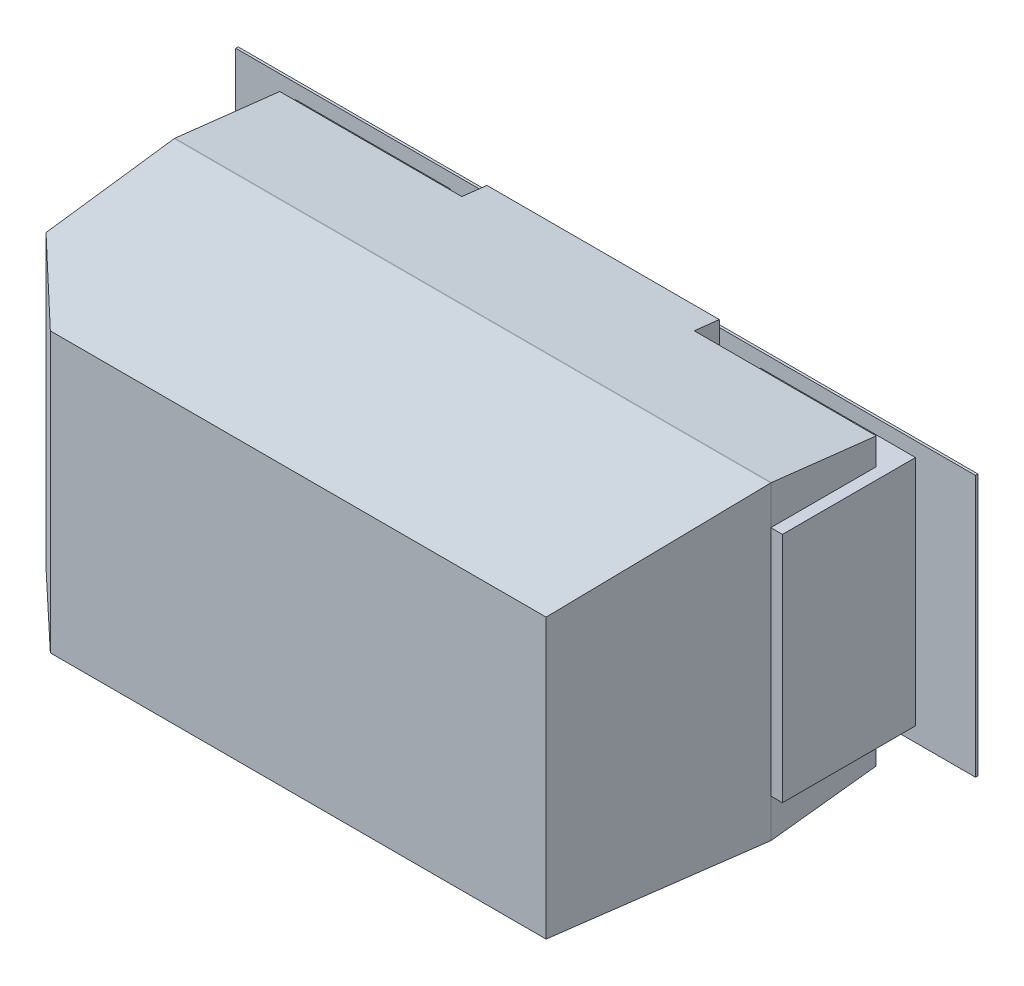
ISO-10303-21;
HEADER;
FILE_DESCRIPTION(('STEP AP214'),'2;1');
FILE_NAME('part.step','',(''),(''),'','','');
FILE_SCHEMA(('AUTOMOTIVE_DESIGN { 1 0 10303 214 1 1 1 1 }'));
ENDSEC;
DATA;
#1=APPLICATION_CONTEXT('core data for automotive mechanical design processes');
#2=APPLICATION_PROTOCOL_DEFINITION('international standard','automotive_design',2000,#1);
#3=PRODUCT_CONTEXT('',#1,'mechanical');
#4=PRODUCT('Part','Part','',(#3));
#5=PRODUCT_RELATED_PRODUCT_CATEGORY('part','',(#4));
#6=PRODUCT_DEFINITION_FORMATION('','',#4);
#7=PRODUCT_DEFINITION_CONTEXT('part definition',#1,'design');
#8=PRODUCT_DEFINITION('design','',#6,#7);
#9=PRODUCT_DEFINITION_SHAPE('','',#8);
#10=(LENGTH_UNIT() NAMED_UNIT(*) SI_UNIT(.MILLI.,.METRE.));
#11=(NAMED_UNIT(*) PLANE_ANGLE_UNIT() SI_UNIT($,.RADIAN.));
#12=(NAMED_UNIT(*) SI_UNIT($,.STERADIAN.) SOLID_ANGLE_UNIT());
#13=UNCERTAINTY_MEASURE_WITH_UNIT(LENGTH_MEASURE(1.E-05),#10,'distance_accuracy_value','');
#14=(GEOMETRIC_REPRESENTATION_CONTEXT(3) GLOBAL_UNCERTAINTY_ASSIGNED_CONTEXT((#13)) GLOBAL_UNIT_ASSIGNED_CONTEXT((#10,
#11,#12)) REPRESENTATION_CONTEXT('',''));
#15=CARTESIAN_POINT('',(0.,0.,0.));
#16=DIRECTION('',(0.,0.,1.));
#17=DIRECTION('',(1.,0.,0.));
#18=AXIS2_PLACEMENT_3D('',#15,#16,#17);
#19=CARTESIAN_POINT('',(-0.800000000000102,-0.599999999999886,0.0762));
#20=DIRECTION('',(0.,0.,-1.));
#21=DIRECTION('',(-1.,0.,0.));
#22=AXIS2_PLACEMENT_3D('',#19,#20,#21);
#23=PLANE('',#22);
#24=DIRECTION('',(0.,1.,0.));
#25=VECTOR('',#24,1.);
#26=CARTESIAN_POINT('',(-1.90999999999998,0.675000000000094,0.0762));
#27=LINE('',#26,#25);
#28=CARTESIAN_POINT('',(-1.90999999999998,0.675000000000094,0.0762));
#29=VERTEX_POINT('',#28);
#30=CARTESIAN_POINT('',(-1.90999999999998,-0.675000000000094,0.0762));
#31=VERTEX_POINT('',#30);
#32=EDGE_CURVE('E19',#29,#31,#27,.F.);
#33=ORIENTED_EDGE('',*,*,#32,.F.);
#34=DIRECTION('',(1.,0.,0.));
#35=VECTOR('',#34,1.);
#36=CARTESIAN_POINT('',(-0.490000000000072,0.675000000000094,0.0762));
#37=LINE('',#36,#35);
#38=CARTESIAN_POINT('',(-0.490000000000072,0.675000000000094,0.0762));
#39=VERTEX_POINT('',#38);
#40=EDGE_CURVE('E281',#39,#29,#37,.F.);
#41=ORIENTED_EDGE('',*,*,#40,.F.);
#42=DIRECTION('',(0.,1.,0.));
#43=VECTOR('',#42,1.);
#44=CARTESIAN_POINT('',(-0.490000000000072,-0.675000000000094,0.0762));
#45=LINE('',#44,#43);
#46=CARTESIAN_POINT('',(-0.490000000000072,-0.675000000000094,0.0762));
#47=VERTEX_POINT('',#46);
#48=EDGE_CURVE('E266',#47,#39,#45,.T.);
#49=ORIENTED_EDGE('',*,*,#48,.F.);
#50=DIRECTION('',(1.,0.,0.));
#51=VECTOR('',#50,1.);
#52=CARTESIAN_POINT('',(-1.90999999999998,-0.675000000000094,0.0762));
#53=LINE('',#52,#51);
#54=EDGE_CURVE('E253',#31,#47,#53,.T.);
#55=ORIENTED_EDGE('',*,*,#54,.F.);
#56=EDGE_LOOP('',(#33,#41,#49,#55));
#57=FACE_BOUND('',#56,.T.);
#58=ADVANCED_FACE('F16',(#57),#23,.T.);
#59=CARTESIAN_POINT('',(-0.800000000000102,-0.599999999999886,0.0762));
#60=DIRECTION('',(0.,0.,-1.));
#61=DIRECTION('',(-1.,0.,0.));
#62=AXIS2_PLACEMENT_3D('',#59,#60,#61);
#63=PLANE('',#62);
#64=DIRECTION('',(0.,1.,0.));
#65=VECTOR('',#64,1.);
#66=CARTESIAN_POINT('',(0.490000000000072,0.675000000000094,0.0762));
#67=LINE('',#66,#65);
#68=CARTESIAN_POINT('',(0.490000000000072,0.675000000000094,0.0762));
#69=VERTEX_POINT('',#68);
#70=CARTESIAN_POINT('',(0.490000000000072,-0.675000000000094,0.0762));
#71=VERTEX_POINT('',#70);
#72=EDGE_CURVE('E283',#69,#71,#67,.F.);
#73=ORIENTED_EDGE('',*,*,#72,.F.);
#74=DIRECTION('',(1.,0.,0.));
#75=VECTOR('',#74,1.);
#76=CARTESIAN_POINT('',(1.90999999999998,0.675000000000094,0.0762));
#77=LINE('',#76,#75);
#78=CARTESIAN_POINT('',(1.90999999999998,0.675000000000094,0.0762));
#79=VERTEX_POINT('',#78);
#80=EDGE_CURVE('E301',#79,#69,#77,.F.);
#81=ORIENTED_EDGE('',*,*,#80,.F.);
#82=DIRECTION('',(0.,1.,0.));
#83=VECTOR('',#82,1.);
#84=CARTESIAN_POINT('',(1.90999999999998,-0.675000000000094,0.0762));
#85=LINE('',#84,#83);
#86=CARTESIAN_POINT('',(1.90999999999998,-0.675000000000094,0.0762));
#87=VERTEX_POINT('',#86);
#88=EDGE_CURVE('E293',#87,#79,#85,.T.);
#89=ORIENTED_EDGE('',*,*,#88,.F.);
#90=DIRECTION('',(1.,0.,0.));
#91=VECTOR('',#90,1.);
#92=CARTESIAN_POINT('',(0.490000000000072,-0.675000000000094,0.0762));
#93=LINE('',#92,#91);
#94=EDGE_CURVE('E288',#71,#87,#93,.T.);
#95=ORIENTED_EDGE('',*,*,#94,.F.);
#96=EDGE_LOOP('',(#73,#81,#89,#95));
#97=FACE_BOUND('',#96,.T.);
#98=ADVANCED_FACE('F981',(#97),#63,.T.);
#99=CARTESIAN_POINT('',(-1.90999999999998,0.675000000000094,0.0762));
#100=DIRECTION('',(-1.,0.,0.));
#101=DIRECTION('',(0.,0.,1.));
#102=AXIS2_PLACEMENT_3D('',#99,#100,#101);
#103=PLANE('',#102);
#104=DIRECTION('',(0.,0.,1.));
#105=VECTOR('',#104,1.);
#106=CARTESIAN_POINT('',(-1.90999999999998,0.675000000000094,0.0762));
#107=LINE('',#106,#105);
#108=CARTESIAN_POINT('',(-1.90999999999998,0.675000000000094,0.0889));
#109=VERTEX_POINT('',#108);
#110=EDGE_CURVE('E262',#29,#109,#107,.T.);
#111=ORIENTED_EDGE('',*,*,#110,.F.);
#112=ORIENTED_EDGE('',*,*,#32,.T.);
#113=DIRECTION('',(0.,0.,-1.));
#114=VECTOR('',#113,1.);
#115=CARTESIAN_POINT('',(-1.90999999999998,-0.675000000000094,0.0762));
#116=LINE('',#115,#114);
#117=CARTESIAN_POINT('',(-1.90999999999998,-0.675000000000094,0.0889));
#118=VERTEX_POINT('',#117);
#119=EDGE_CURVE('E259',#118,#31,#116,.T.);
#120=ORIENTED_EDGE('',*,*,#119,.F.);
#121=DIRECTION('',(0.,1.,0.));
#122=VECTOR('',#121,1.);
#123=CARTESIAN_POINT('',(-1.90999999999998,0.,0.0889));
#124=LINE('',#123,#122);
#125=EDGE_CURVE('E304',#109,#118,#124,.F.);
#126=ORIENTED_EDGE('',*,*,#125,.F.);
#127=EDGE_LOOP('',(#111,#112,#120,#126));
#128=FACE_BOUND('',#127,.T.);
#129=ADVANCED_FACE('F258',(#128),#103,.T.);
#130=CARTESIAN_POINT('',(-1.90999999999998,-0.675000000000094,0.0762));
#131=DIRECTION('',(0.,-1.,0.));
#132=DIRECTION('',(0.,0.,-1.));
#133=AXIS2_PLACEMENT_3D('',#130,#131,#132);
#134=PLANE('',#133);
#135=ORIENTED_EDGE('',*,*,#119,.T.);
#136=ORIENTED_EDGE('',*,*,#54,.T.);
#137=DIRECTION('',(0.,0.,-1.));
#138=VECTOR('',#137,1.);
#139=CARTESIAN_POINT('',(-0.490000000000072,-0.675000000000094,0.0762));
#140=LINE('',#139,#138);
#141=CARTESIAN_POINT('',(-0.490000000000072,-0.675000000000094,0.0889));
#142=VERTEX_POINT('',#141);
#143=EDGE_CURVE('E268',#142,#47,#140,.T.);
#144=ORIENTED_EDGE('',*,*,#143,.F.);
#145=DIRECTION('',(1.,0.,0.));
#146=VECTOR('',#145,1.);
#147=CARTESIAN_POINT('',(0.,-0.675000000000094,0.0889));
#148=LINE('',#147,#146);
#149=EDGE_CURVE('E272',#118,#142,#148,.T.);
#150=ORIENTED_EDGE('',*,*,#149,.F.);
#151=EDGE_LOOP('',(#135,#136,#144,#150));
#152=FACE_BOUND('',#151,.T.);
#153=ADVANCED_FACE('F270',(#152),#134,.T.);
#154=CARTESIAN_POINT('',(-0.490000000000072,-0.675000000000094,0.0762));
#155=DIRECTION('',(1.,0.,0.));
#156=DIRECTION('',(0.,0.,-1.));
#157=AXIS2_PLACEMENT_3D('',#154,#155,#156);
#158=PLANE('',#157);
#159=ORIENTED_EDGE('',*,*,#143,.T.);
#160=ORIENTED_EDGE('',*,*,#48,.T.);
#161=DIRECTION('',(0.,0.,1.));
#162=VECTOR('',#161,1.);
#163=CARTESIAN_POINT('',(-0.490000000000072,0.675000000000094,0.0762));
#164=LINE('',#163,#162);
#165=CARTESIAN_POINT('',(-0.490000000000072,0.675000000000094,0.0889));
#166=VERTEX_POINT('',#165);
#167=EDGE_CURVE('E278',#166,#39,#164,.F.);
#168=ORIENTED_EDGE('',*,*,#167,.F.);
#169=DIRECTION('',(0.,1.,0.));
#170=VECTOR('',#169,1.);
#171=CARTESIAN_POINT('',(-0.490000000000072,0.,0.0889));
#172=LINE('',#171,#170);
#173=EDGE_CURVE('E307',#142,#166,#172,.T.);
#174=ORIENTED_EDGE('',*,*,#173,.F.);
#175=EDGE_LOOP('',(#159,#160,#168,#174));
#176=FACE_BOUND('',#175,.T.);
#177=ADVANCED_FACE('F1035',(#176),#158,.T.);
#178=CARTESIAN_POINT('',(-0.490000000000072,0.675000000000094,0.0762));
#179=DIRECTION('',(0.,1.,0.));
#180=DIRECTION('',(0.,0.,1.));
#181=AXIS2_PLACEMENT_3D('',#178,#179,#180);
#182=PLANE('',#181);
#183=ORIENTED_EDGE('',*,*,#167,.T.);
#184=ORIENTED_EDGE('',*,*,#40,.T.);
#185=ORIENTED_EDGE('',*,*,#110,.T.);
#186=DIRECTION('',(1.,0.,0.));
#187=VECTOR('',#186,1.);
#188=CARTESIAN_POINT('',(0.,0.675000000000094,0.0889));
#189=LINE('',#188,#187);
#190=EDGE_CURVE('E310',#166,#109,#189,.F.);
#191=ORIENTED_EDGE('',*,*,#190,.F.);
#192=EDGE_LOOP('',(#183,#184,#185,#191));
#193=FACE_BOUND('',#192,.T.);
#194=ADVANCED_FACE('F1042',(#193),#182,.T.);
#195=CARTESIAN_POINT('',(0.490000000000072,0.675000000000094,0.0762));
#196=DIRECTION('',(-1.,0.,0.));
#197=DIRECTION('',(0.,0.,1.));
#198=AXIS2_PLACEMENT_3D('',#195,#196,#197);
#199=PLANE('',#198);
#200=DIRECTION('',(0.,0.,1.));
#201=VECTOR('',#200,1.);
#202=CARTESIAN_POINT('',(0.490000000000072,0.675000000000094,0.0762));
#203=LINE('',#202,#201);
#204=CARTESIAN_POINT('',(0.490000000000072,0.675000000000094,0.0889));
#205=VERTEX_POINT('',#204);
#206=EDGE_CURVE('E295',#69,#205,#203,.T.);
#207=ORIENTED_EDGE('',*,*,#206,.F.);
#208=ORIENTED_EDGE('',*,*,#72,.T.);
#209=DIRECTION('',(0.,0.,-1.));
#210=VECTOR('',#209,1.);
#211=CARTESIAN_POINT('',(0.490000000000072,-0.675000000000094,0.0762));
#212=LINE('',#211,#210);
#213=CARTESIAN_POINT('',(0.490000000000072,-0.675000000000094,0.0889));
#214=VERTEX_POINT('',#213);
#215=EDGE_CURVE('E285',#214,#71,#212,.T.);
#216=ORIENTED_EDGE('',*,*,#215,.F.);
#217=DIRECTION('',(0.,1.,0.));
#218=VECTOR('',#217,1.);
#219=CARTESIAN_POINT('',(0.490000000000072,0.,0.0889));
#220=LINE('',#219,#218);
#221=EDGE_CURVE('E345',#205,#214,#220,.F.);
#222=ORIENTED_EDGE('',*,*,#221,.F.);
#223=EDGE_LOOP('',(#207,#208,#216,#222));
#224=FACE_BOUND('',#223,.T.);
#225=ADVANCED_FACE('F1050',(#224),#199,.T.);
#226=CARTESIAN_POINT('',(0.490000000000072,-0.675000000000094,0.0762));
#227=DIRECTION('',(0.,-1.,0.));
#228=DIRECTION('',(0.,0.,-1.));
#229=AXIS2_PLACEMENT_3D('',#226,#227,#228);
#230=PLANE('',#229);
#231=ORIENTED_EDGE('',*,*,#215,.T.);
#232=ORIENTED_EDGE('',*,*,#94,.T.);
#233=DIRECTION('',(0.,0.,-1.));
#234=VECTOR('',#233,1.);
#235=CARTESIAN_POINT('',(1.90999999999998,-0.675000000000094,0.0762));
#236=LINE('',#235,#234);
#237=CARTESIAN_POINT('',(1.90999999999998,-0.675000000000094,0.0889));
#238=VERTEX_POINT('',#237);
#239=EDGE_CURVE('E290',#238,#87,#236,.T.);
#240=ORIENTED_EDGE('',*,*,#239,.F.);
#241=DIRECTION('',(1.,0.,0.));
#242=VECTOR('',#241,1.);
#243=CARTESIAN_POINT('',(0.,-0.675000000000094,0.0889));
#244=LINE('',#243,#242);
#245=EDGE_CURVE('E348',#214,#238,#244,.T.);
#246=ORIENTED_EDGE('',*,*,#245,.F.);
#247=EDGE_LOOP('',(#231,#232,#240,#246));
#248=FACE_BOUND('',#247,.T.);
#249=ADVANCED_FACE('F1058',(#248),#230,.T.);
#250=CARTESIAN_POINT('',(1.90999999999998,-0.675000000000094,0.0762));
#251=DIRECTION('',(1.,0.,0.));
#252=DIRECTION('',(0.,0.,-1.));
#253=AXIS2_PLACEMENT_3D('',#250,#251,#252);
#254=PLANE('',#253);
#255=ORIENTED_EDGE('',*,*,#239,.T.);
#256=ORIENTED_EDGE('',*,*,#88,.T.);
#257=DIRECTION('',(0.,0.,1.));
#258=VECTOR('',#257,1.);
#259=CARTESIAN_POINT('',(1.90999999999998,0.675000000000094,0.0762));
#260=LINE('',#259,#258);
#261=CARTESIAN_POINT('',(1.90999999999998,0.675000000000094,0.0889));
#262=VERTEX_POINT('',#261);
#263=EDGE_CURVE('E298',#262,#79,#260,.F.);
#264=ORIENTED_EDGE('',*,*,#263,.F.);
#265=DIRECTION('',(0.,1.,0.));
#266=VECTOR('',#265,1.);
#267=CARTESIAN_POINT('',(1.90999999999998,0.,0.0889));
#268=LINE('',#267,#266);
#269=EDGE_CURVE('E351',#238,#262,#268,.T.);
#270=ORIENTED_EDGE('',*,*,#269,.F.);
#271=EDGE_LOOP('',(#255,#256,#264,#270));
#272=FACE_BOUND('',#271,.T.);
#273=ADVANCED_FACE('F1066',(#272),#254,.T.);
#274=CARTESIAN_POINT('',(1.90999999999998,0.675000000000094,0.0762));
#275=DIRECTION('',(0.,1.,0.));
#276=DIRECTION('',(0.,0.,1.));
#277=AXIS2_PLACEMENT_3D('',#274,#275,#276);
#278=PLANE('',#277);
#279=ORIENTED_EDGE('',*,*,#263,.T.);
#280=ORIENTED_EDGE('',*,*,#80,.T.);
#281=ORIENTED_EDGE('',*,*,#206,.T.);
#282=DIRECTION('',(1.,0.,0.));
#283=VECTOR('',#282,1.);
#284=CARTESIAN_POINT('',(0.,0.675000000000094,0.0889));
#285=LINE('',#284,#283);
#286=EDGE_CURVE('E354',#262,#205,#285,.F.);
#287=ORIENTED_EDGE('',*,*,#286,.F.);
#288=EDGE_LOOP('',(#279,#280,#281,#287));
#289=FACE_BOUND('',#288,.T.);
#290=ADVANCED_FACE('F972',(#289),#278,.T.);
#291=CARTESIAN_POINT('',(0.,0.,0.0889));
#292=DIRECTION('',(0.,0.,1.));
#293=DIRECTION('',(1.,0.,0.));
#294=AXIS2_PLACEMENT_3D('',#291,#292,#293);
#295=PLANE('',#294);
#296=DIRECTION('',(0.,1.,0.));
#297=VECTOR('',#296,1.);
#298=CARTESIAN_POINT('',(-0.800000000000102,-0.599999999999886,0.0889));
#299=LINE('',#298,#297);
#300=CARTESIAN_POINT('',(-0.800000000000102,-0.599999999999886,0.0889));
#301=VERTEX_POINT('',#300);
#302=CARTESIAN_POINT('',(-0.800000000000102,0.599999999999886,0.0889));
#303=VERTEX_POINT('',#302);
#304=EDGE_CURVE('E313',#301,#303,#299,.T.);
#305=ORIENTED_EDGE('',*,*,#304,.F.);
#306=DIRECTION('',(1.,0.,0.));
#307=VECTOR('',#306,1.);
#308=CARTESIAN_POINT('',(0.,-0.599999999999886,0.0889));
#309=LINE('',#308,#307);
#310=CARTESIAN_POINT('',(-1.59999999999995,-0.599999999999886,0.0889));
#311=VERTEX_POINT('',#310);
#312=EDGE_CURVE('E338',#301,#311,#309,.F.);
#313=ORIENTED_EDGE('',*,*,#312,.T.);
#314=DIRECTION('',(0.,1.,0.));
#315=VECTOR('',#314,1.);
#316=CARTESIAN_POINT('',(-1.59999999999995,-0.599999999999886,0.0889));
#317=LINE('',#316,#315);
#318=CARTESIAN_POINT('',(-1.59999999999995,0.599999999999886,0.0889));
#319=VERTEX_POINT('',#318);
#320=EDGE_CURVE('E330',#319,#311,#317,.F.);
#321=ORIENTED_EDGE('',*,*,#320,.F.);
#322=DIRECTION('',(1.,0.,0.));
#323=VECTOR('',#322,1.);
#324=CARTESIAN_POINT('',(0.,0.599999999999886,0.0889));
#325=LINE('',#324,#323);
#326=EDGE_CURVE('E365',#303,#319,#325,.F.);
#327=ORIENTED_EDGE('',*,*,#326,.F.);
#328=EDGE_LOOP('',(#305,#313,#321,#327));
#329=FACE_BOUND('',#328,.T.);
#330=ORIENTED_EDGE('',*,*,#173,.T.);
#331=ORIENTED_EDGE('',*,*,#190,.T.);
#332=ORIENTED_EDGE('',*,*,#125,.T.);
#333=ORIENTED_EDGE('',*,*,#149,.T.);
#334=EDGE_LOOP('',(#330,#331,#332,#333));
#335=FACE_BOUND('',#334,.T.);
#336=ADVANCED_FACE('F638',(#329,#335),#295,.T.);
#337=CARTESIAN_POINT('',(-0.800000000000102,-0.599999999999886,0.231599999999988));
#338=DIRECTION('',(1.,0.,0.));
#339=DIRECTION('',(0.,0.,-1.));
#340=AXIS2_PLACEMENT_3D('',#337,#338,#339);
#341=PLANE('',#340);
#342=DIRECTION('',(0.,0.,1.));
#343=VECTOR('',#342,1.);
#344=CARTESIAN_POINT('',(-0.800000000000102,-0.599999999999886,0.));
#345=LINE('',#344,#343);
#346=CARTESIAN_POINT('',(-0.800000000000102,-0.599999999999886,0.231599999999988));
#347=VERTEX_POINT('',#346);
#348=EDGE_CURVE('E342',#347,#301,#345,.F.);
#349=ORIENTED_EDGE('',*,*,#348,.T.);
#350=ORIENTED_EDGE('',*,*,#304,.T.);
#351=DIRECTION('',(0.,0.,1.));
#352=VECTOR('',#351,1.);
#353=CARTESIAN_POINT('',(-0.800000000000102,0.599999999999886,0.));
#354=LINE('',#353,#352);
#355=CARTESIAN_POINT('',(-0.800000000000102,0.599999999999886,0.231599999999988));
#356=VERTEX_POINT('',#355);
#357=EDGE_CURVE('E362',#356,#303,#354,.F.);
#358=ORIENTED_EDGE('',*,*,#357,.F.);
#359=DIRECTION('',(0.,1.,0.));
#360=VECTOR('',#359,1.);
#361=CARTESIAN_POINT('',(-0.800000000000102,-0.800000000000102,0.231599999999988));
#362=LINE('',#361,#360);
#363=EDGE_CURVE('E371',#356,#347,#362,.F.);
#364=ORIENTED_EDGE('',*,*,#363,.T.);
#365=EDGE_LOOP('',(#349,#350,#358,#364));
#366=FACE_BOUND('',#365,.T.);
#367=ADVANCED_FACE('F636',(#366),#341,.T.);
#368=CARTESIAN_POINT('',(-0.599999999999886,-0.800000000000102,0.1016));
#369=DIRECTION('',(1.,0.,0.));
#370=DIRECTION('',(0.,0.,-1.));
#371=AXIS2_PLACEMENT_3D('',#368,#369,#370);
#372=PLANE('',#371);
#373=DIRECTION('',(0.,0.113546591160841,-0.993532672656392));
#374=VECTOR('',#373,1.);
#375=CARTESIAN_POINT('',(-0.599999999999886,-0.738073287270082,0.231599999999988));
#376=LINE('',#375,#374);
#377=CARTESIAN_POINT('',(-0.599999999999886,-0.73807328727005,0.231599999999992));
#378=VERTEX_POINT('',#377);
#379=CARTESIAN_POINT('',(-0.599999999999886,-0.723216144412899,0.101600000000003));
#380=VERTEX_POINT('',#379);
#381=EDGE_CURVE('E317',#378,#380,#376,.T.);
#382=ORIENTED_EDGE('',*,*,#381,.F.);
#383=DIRECTION('',(0.,1.,0.));
#384=VECTOR('',#383,1.);
#385=CARTESIAN_POINT('',(-0.599999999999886,-0.800000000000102,0.231599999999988));
#386=LINE('',#385,#384);
#387=CARTESIAN_POINT('',(-0.599999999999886,0.738073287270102,0.231599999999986));
#388=VERTEX_POINT('',#387);
#389=EDGE_CURVE('E375',#378,#388,#386,.T.);
#390=ORIENTED_EDGE('',*,*,#389,.T.);
#391=DIRECTION('',(0.,0.11354659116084,0.993532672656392));
#392=VECTOR('',#391,1.);
#393=CARTESIAN_POINT('',(-0.599999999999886,0.723216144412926,0.1016));
#394=LINE('',#393,#392);
#395=CARTESIAN_POINT('',(-0.599999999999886,0.723216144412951,0.101599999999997));
#396=VERTEX_POINT('',#395);
#397=EDGE_CURVE('E315',#396,#388,#394,.T.);
#398=ORIENTED_EDGE('',*,*,#397,.F.);
#399=DIRECTION('',(0.,1.,0.));
#400=VECTOR('',#399,1.);
#401=CARTESIAN_POINT('',(-0.599999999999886,-0.800000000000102,0.1016));
#402=LINE('',#401,#400);
#403=EDGE_CURVE('E378',#396,#380,#402,.F.);
#404=ORIENTED_EDGE('',*,*,#403,.T.);
#405=EDGE_LOOP('',(#382,#390,#398,#404));
#406=FACE_BOUND('',#405,.T.);
#407=ADVANCED_FACE('F672',(#406),#372,.F.);
#408=CARTESIAN_POINT('',(0.599999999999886,-0.800000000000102,0.231599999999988));
#409=DIRECTION('',(-1.,0.,0.));
#410=DIRECTION('',(0.,0.,1.));
#411=AXIS2_PLACEMENT_3D('',#408,#409,#410);
#412=PLANE('',#411);
#413=DIRECTION('',(0.,-0.113546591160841,0.993532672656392));
#414=VECTOR('',#413,1.);
#415=CARTESIAN_POINT('',(0.599999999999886,-0.723216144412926,0.1016));
#416=LINE('',#415,#414);
#417=CARTESIAN_POINT('',(0.599999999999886,-0.723216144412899,0.101600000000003));
#418=VERTEX_POINT('',#417);
#419=CARTESIAN_POINT('',(0.599999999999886,-0.73807328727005,0.231599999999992));
#420=VERTEX_POINT('',#419);
#421=EDGE_CURVE('E321',#418,#420,#416,.T.);
#422=ORIENTED_EDGE('',*,*,#421,.F.);
#423=DIRECTION('',(0.,1.,0.));
#424=VECTOR('',#423,1.);
#425=CARTESIAN_POINT('',(0.599999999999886,-0.800000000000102,0.1016));
#426=LINE('',#425,#424);
#427=CARTESIAN_POINT('',(0.599999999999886,0.723216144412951,0.101599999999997));
#428=VERTEX_POINT('',#427);
#429=EDGE_CURVE('E381',#418,#428,#426,.T.);
#430=ORIENTED_EDGE('',*,*,#429,.T.);
#431=DIRECTION('',(0.,-0.11354659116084,-0.993532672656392));
#432=VECTOR('',#431,1.);
#433=CARTESIAN_POINT('',(0.599999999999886,0.738073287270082,0.231599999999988));
#434=LINE('',#433,#432);
#435=CARTESIAN_POINT('',(0.599999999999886,0.738073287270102,0.231599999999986));
#436=VERTEX_POINT('',#435);
#437=EDGE_CURVE('E319',#436,#428,#434,.T.);
#438=ORIENTED_EDGE('',*,*,#437,.F.);
#439=DIRECTION('',(0.,1.,0.));
#440=VECTOR('',#439,1.);
#441=CARTESIAN_POINT('',(0.599999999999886,-0.800000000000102,0.231599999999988));
#442=LINE('',#441,#440);
#443=EDGE_CURVE('E384',#436,#420,#442,.F.);
#444=ORIENTED_EDGE('',*,*,#443,.T.);
#445=EDGE_LOOP('',(#422,#430,#438,#444));
#446=FACE_BOUND('',#445,.T.);
#447=ADVANCED_FACE('F664',(#446),#412,.F.);
#448=CARTESIAN_POINT('',(-1.59999999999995,0.199999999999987,0.476199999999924));
#449=DIRECTION('',(0.,0.,-1.));
#450=DIRECTION('',(-1.,0.,0.));
#451=AXIS2_PLACEMENT_3D('',#448,#449,#450);
#452=PLANE('',#451);
#453=DIRECTION('',(0.,1.,0.));
#454=VECTOR('',#453,1.);
#455=CARTESIAN_POINT('',(-1.53999999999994,-0.800000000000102,0.476199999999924));
#456=LINE('',#455,#454);
#457=CARTESIAN_POINT('',(-1.53999999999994,-0.199999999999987,0.476199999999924));
#458=VERTEX_POINT('',#457);
#459=CARTESIAN_POINT('',(-1.53999999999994,0.199999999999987,0.476199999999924));
#460=VERTEX_POINT('',#459);
#461=EDGE_CURVE('E396',#458,#460,#456,.T.);
#462=ORIENTED_EDGE('',*,*,#461,.T.);
#463=DIRECTION('',(1.,0.,0.));
#464=VECTOR('',#463,1.);
#465=CARTESIAN_POINT('',(-1.59999999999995,0.199999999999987,0.476199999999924));
#466=LINE('',#465,#464);
#467=CARTESIAN_POINT('',(-1.59999999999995,0.199999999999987,0.476199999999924));
#468=VERTEX_POINT('',#467);
#469=EDGE_CURVE('E323',#460,#468,#466,.F.);
#470=ORIENTED_EDGE('',*,*,#469,.T.);
#471=DIRECTION('',(0.,1.,0.));
#472=VECTOR('',#471,1.);
#473=CARTESIAN_POINT('',(-1.59999999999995,-0.599999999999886,0.476199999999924));
#474=LINE('',#473,#472);
#475=CARTESIAN_POINT('',(-1.59999999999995,-0.199999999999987,0.476199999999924));
#476=VERTEX_POINT('',#475);
#477=EDGE_CURVE('E325',#476,#468,#474,.T.);
#478=ORIENTED_EDGE('',*,*,#477,.F.);
#479=DIRECTION('',(1.,0.,0.));
#480=VECTOR('',#479,1.);
#481=CARTESIAN_POINT('',(-1.59999999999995,-0.199999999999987,0.476199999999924));
#482=LINE('',#481,#480);
#483=EDGE_CURVE('E336',#476,#458,#482,.T.);
#484=ORIENTED_EDGE('',*,*,#483,.T.);
#485=EDGE_LOOP('',(#462,#470,#478,#484));
#486=FACE_BOUND('',#485,.T.);
#487=ADVANCED_FACE('F662',(#486),#452,.F.);
#488=CARTESIAN_POINT('',(-1.59999999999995,0.199999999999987,0.776199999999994));
#489=DIRECTION('',(0.,1.,0.));
#490=DIRECTION('',(0.,0.,1.));
#491=AXIS2_PLACEMENT_3D('',#488,#489,#490);
#492=PLANE('',#491);
#493=DIRECTION('',(0.,0.,-1.));
#494=VECTOR('',#493,1.);
#495=CARTESIAN_POINT('',(-1.53999999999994,0.199999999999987,0.0762));
#496=LINE('',#495,#494);
#497=CARTESIAN_POINT('',(-1.53999999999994,0.199999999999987,0.776199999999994));
#498=VERTEX_POINT('',#497);
#499=EDGE_CURVE('E398',#460,#498,#496,.F.);
#500=ORIENTED_EDGE('',*,*,#499,.T.);
#501=DIRECTION('',(1.,0.,0.));
#502=VECTOR('',#501,1.);
#503=CARTESIAN_POINT('',(-1.59999999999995,0.199999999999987,0.776199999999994));
#504=LINE('',#503,#502);
#505=CARTESIAN_POINT('',(-1.59999999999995,0.199999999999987,0.776199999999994));
#506=VERTEX_POINT('',#505);
#507=EDGE_CURVE('E406',#506,#498,#504,.T.);
#508=ORIENTED_EDGE('',*,*,#507,.F.);
#509=DIRECTION('',(0.,0.,1.));
#510=VECTOR('',#509,1.);
#511=CARTESIAN_POINT('',(-1.59999999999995,0.199999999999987,0.0762));
#512=LINE('',#511,#510);
#513=EDGE_CURVE('E328',#468,#506,#512,.T.);
#514=ORIENTED_EDGE('',*,*,#513,.F.);
#515=ORIENTED_EDGE('',*,*,#469,.F.);
#516=EDGE_LOOP('',(#500,#508,#514,#515));
#517=FACE_BOUND('',#516,.T.);
#518=ADVANCED_FACE('F650',(#517),#492,.F.);
#519=CARTESIAN_POINT('',(-1.59999999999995,-0.599999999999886,0.0762));
#520=DIRECTION('',(-1.,0.,0.));
#521=DIRECTION('',(0.,0.,1.));
#522=AXIS2_PLACEMENT_3D('',#519,#520,#521);
#523=PLANE('',#522);
#524=DIRECTION('',(0.,0.,1.));
#525=VECTOR('',#524,1.);
#526=CARTESIAN_POINT('',(-1.59999999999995,0.599999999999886,0.));
#527=LINE('',#526,#525);
#528=CARTESIAN_POINT('',(-1.59999999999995,0.599999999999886,0.776199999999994));
#529=VERTEX_POINT('',#528);
#530=EDGE_CURVE('E360',#319,#529,#527,.T.);
#531=ORIENTED_EDGE('',*,*,#530,.F.);
#532=ORIENTED_EDGE('',*,*,#320,.T.);
#533=DIRECTION('',(0.,0.,1.));
#534=VECTOR('',#533,1.);
#535=CARTESIAN_POINT('',(-1.59999999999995,-0.599999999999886,0.));
#536=LINE('',#535,#534);
#537=CARTESIAN_POINT('',(-1.59999999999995,-0.599999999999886,0.776199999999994));
#538=VERTEX_POINT('',#537);
#539=EDGE_CURVE('E340',#311,#538,#536,.T.);
#540=ORIENTED_EDGE('',*,*,#539,.T.);
#541=DIRECTION('',(0.,1.,0.));
#542=VECTOR('',#541,1.);
#543=CARTESIAN_POINT('',(-1.59999999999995,-0.599999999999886,0.776199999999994));
#544=LINE('',#543,#542);
#545=CARTESIAN_POINT('',(-1.59999999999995,-0.199999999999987,0.776199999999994));
#546=VERTEX_POINT('',#545);
#547=EDGE_CURVE('E409',#546,#538,#544,.F.);
#548=ORIENTED_EDGE('',*,*,#547,.F.);
#549=DIRECTION('',(0.,0.,-1.));
#550=VECTOR('',#549,1.);
#551=CARTESIAN_POINT('',(-1.59999999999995,-0.199999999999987,0.476199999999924));
#552=LINE('',#551,#550);
#553=EDGE_CURVE('E333',#546,#476,#552,.T.);
#554=ORIENTED_EDGE('',*,*,#553,.T.);
#555=ORIENTED_EDGE('',*,*,#477,.T.);
#556=ORIENTED_EDGE('',*,*,#513,.T.);
#557=DIRECTION('',(0.,1.,0.));
#558=VECTOR('',#557,1.);
#559=CARTESIAN_POINT('',(-1.59999999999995,-0.599999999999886,0.776199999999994));
#560=LINE('',#559,#558);
#561=EDGE_CURVE('E403',#529,#506,#560,.F.);
#562=ORIENTED_EDGE('',*,*,#561,.F.);
#563=EDGE_LOOP('',(#531,#532,#540,#548,#554,#555,#556,#562));
#564=FACE_BOUND('',#563,.T.);
#565=ADVANCED_FACE('F643',(#564),#523,.T.);
#566=CARTESIAN_POINT('',(-1.59999999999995,-0.199999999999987,0.476199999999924));
#567=DIRECTION('',(0.,-1.,0.));
#568=DIRECTION('',(0.,0.,-1.));
#569=AXIS2_PLACEMENT_3D('',#566,#567,#568);
#570=PLANE('',#569);
#571=DIRECTION('',(0.,0.,-1.));
#572=VECTOR('',#571,1.);
#573=CARTESIAN_POINT('',(-1.53999999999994,-0.199999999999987,0.0762));
#574=LINE('',#573,#572);
#575=CARTESIAN_POINT('',(-1.53999999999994,-0.199999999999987,0.776199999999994));
#576=VERTEX_POINT('',#575);
#577=EDGE_CURVE('E393',#576,#458,#574,.T.);
#578=ORIENTED_EDGE('',*,*,#577,.T.);
#579=ORIENTED_EDGE('',*,*,#483,.F.);
#580=ORIENTED_EDGE('',*,*,#553,.F.);
#581=DIRECTION('',(1.,0.,0.));
#582=VECTOR('',#581,1.);
#583=CARTESIAN_POINT('',(-1.59999999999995,-0.199999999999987,0.776199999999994));
#584=LINE('',#583,#582);
#585=EDGE_CURVE('E415',#576,#546,#584,.F.);
#586=ORIENTED_EDGE('',*,*,#585,.F.);
#587=EDGE_LOOP('',(#578,#579,#580,#586));
#588=FACE_BOUND('',#587,.T.);
#589=ADVANCED_FACE('F659',(#588),#570,.F.);
#590=CARTESIAN_POINT('',(0.,-0.599999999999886,0.));
#591=DIRECTION('',(0.,1.,0.));
#592=DIRECTION('',(0.,0.,1.));
#593=AXIS2_PLACEMENT_3D('',#590,#591,#592);
#594=PLANE('',#593);
#595=DIRECTION('',(1.,0.,0.));
#596=VECTOR('',#595,1.);
#597=CARTESIAN_POINT('',(-0.599999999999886,-0.599999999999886,0.231599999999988));
#598=LINE('',#597,#596);
#599=CARTESIAN_POINT('',(-1.53999999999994,-0.599999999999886,0.231599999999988));
#600=VERTEX_POINT('',#599);
#601=EDGE_CURVE('E373',#347,#600,#598,.F.);
#602=ORIENTED_EDGE('',*,*,#601,.T.);
#603=DIRECTION('',(0.,0.,-1.));
#604=VECTOR('',#603,1.);
#605=CARTESIAN_POINT('',(-1.53999999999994,-0.599999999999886,0.0762));
#606=LINE('',#605,#604);
#607=CARTESIAN_POINT('',(-1.53999999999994,-0.599999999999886,0.776199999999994));
#608=VERTEX_POINT('',#607);
#609=EDGE_CURVE('E421',#600,#608,#606,.F.);
#610=ORIENTED_EDGE('',*,*,#609,.T.);
#611=DIRECTION('',(1.,0.,0.));
#612=VECTOR('',#611,1.);
#613=CARTESIAN_POINT('',(-1.59999999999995,-0.599999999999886,0.776199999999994));
#614=LINE('',#613,#612);
#615=EDGE_CURVE('E412',#538,#608,#614,.T.);
#616=ORIENTED_EDGE('',*,*,#615,.F.);
#617=ORIENTED_EDGE('',*,*,#539,.F.);
#618=ORIENTED_EDGE('',*,*,#312,.F.);
#619=ORIENTED_EDGE('',*,*,#348,.F.);
#620=EDGE_LOOP('',(#602,#610,#616,#617,#618,#619));
#621=FACE_BOUND('',#620,.T.);
#622=ADVANCED_FACE('F593',(#621),#594,.F.);
#623=CARTESIAN_POINT('',(0.,0.,0.0889));
#624=DIRECTION('',(0.,0.,1.));
#625=DIRECTION('',(1.,0.,0.));
#626=AXIS2_PLACEMENT_3D('',#623,#624,#625);
#627=PLANE('',#626);
#628=DIRECTION('',(0.,1.,0.));
#629=VECTOR('',#628,1.);
#630=CARTESIAN_POINT('',(1.59999999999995,-0.599999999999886,0.0888999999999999));
#631=LINE('',#630,#629);
#632=CARTESIAN_POINT('',(1.59999999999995,-0.599999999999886,0.0889));
#633=VERTEX_POINT('',#632);
#634=CARTESIAN_POINT('',(1.59999999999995,0.599999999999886,0.0889));
#635=VERTEX_POINT('',#634);
#636=EDGE_CURVE('E435',#633,#635,#631,.T.);
#637=ORIENTED_EDGE('',*,*,#636,.F.);
#638=DIRECTION('',(1.,0.,0.));
#639=VECTOR('',#638,1.);
#640=CARTESIAN_POINT('',(0.,-0.599999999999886,0.0889));
#641=LINE('',#640,#639);
#642=CARTESIAN_POINT('',(0.800000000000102,-0.599999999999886,0.0889));
#643=VERTEX_POINT('',#642);
#644=EDGE_CURVE('E449',#633,#643,#641,.F.);
#645=ORIENTED_EDGE('',*,*,#644,.T.);
#646=DIRECTION('',(0.,1.,0.));
#647=VECTOR('',#646,1.);
#648=CARTESIAN_POINT('',(0.800000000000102,-0.599999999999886,0.0889));
#649=LINE('',#648,#647);
#650=CARTESIAN_POINT('',(0.800000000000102,0.599999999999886,0.0889));
#651=VERTEX_POINT('',#650);
#652=EDGE_CURVE('E357',#651,#643,#649,.F.);
#653=ORIENTED_EDGE('',*,*,#652,.F.);
#654=DIRECTION('',(1.,0.,0.));
#655=VECTOR('',#654,1.);
#656=CARTESIAN_POINT('',(0.,0.599999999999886,0.0889));
#657=LINE('',#656,#655);
#658=EDGE_CURVE('E446',#635,#651,#657,.F.);
#659=ORIENTED_EDGE('',*,*,#658,.F.);
#660=EDGE_LOOP('',(#637,#645,#653,#659));
#661=FACE_BOUND('',#660,.T.);
#662=ORIENTED_EDGE('',*,*,#269,.T.);
#663=ORIENTED_EDGE('',*,*,#286,.T.);
#664=ORIENTED_EDGE('',*,*,#221,.T.);
#665=ORIENTED_EDGE('',*,*,#245,.T.);
#666=EDGE_LOOP('',(#662,#663,#664,#665));
#667=FACE_BOUND('',#666,.T.);
#668=ADVANCED_FACE('F744',(#661,#667),#627,.T.);
#669=CARTESIAN_POINT('',(0.800000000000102,-0.599999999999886,0.0762));
#670=DIRECTION('',(-1.,0.,0.));
#671=DIRECTION('',(0.,0.,1.));
#672=AXIS2_PLACEMENT_3D('',#669,#670,#671);
#673=PLANE('',#672);
#674=DIRECTION('',(0.,0.,1.));
#675=VECTOR('',#674,1.);
#676=CARTESIAN_POINT('',(0.800000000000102,0.599999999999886,0.));
#677=LINE('',#676,#675);
#678=CARTESIAN_POINT('',(0.800000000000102,0.599999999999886,0.231599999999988));
#679=VERTEX_POINT('',#678);
#680=EDGE_CURVE('E437',#651,#679,#677,.T.);
#681=ORIENTED_EDGE('',*,*,#680,.F.);
#682=ORIENTED_EDGE('',*,*,#652,.T.);
#683=DIRECTION('',(0.,0.,1.));
#684=VECTOR('',#683,1.);
#685=CARTESIAN_POINT('',(0.800000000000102,-0.599999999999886,0.));
#686=LINE('',#685,#684);
#687=CARTESIAN_POINT('',(0.800000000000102,-0.599999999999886,0.231599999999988));
#688=VERTEX_POINT('',#687);
#689=EDGE_CURVE('E451',#643,#688,#686,.T.);
#690=ORIENTED_EDGE('',*,*,#689,.T.);
#691=DIRECTION('',(0.,1.,0.));
#692=VECTOR('',#691,1.);
#693=CARTESIAN_POINT('',(0.800000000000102,-0.800000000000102,0.231599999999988));
#694=LINE('',#693,#692);
#695=EDGE_CURVE('E389',#688,#679,#694,.T.);
#696=ORIENTED_EDGE('',*,*,#695,.T.);
#697=EDGE_LOOP('',(#681,#682,#690,#696));
#698=FACE_BOUND('',#697,.T.);
#699=ADVANCED_FACE('F741',(#698),#673,.T.);
#700=CARTESIAN_POINT('',(0.,0.599999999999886,0.));
#701=DIRECTION('',(0.,1.,0.));
#702=DIRECTION('',(0.,0.,1.));
#703=AXIS2_PLACEMENT_3D('',#700,#701,#702);
#704=PLANE('',#703);
#705=ORIENTED_EDGE('',*,*,#357,.T.);
#706=ORIENTED_EDGE('',*,*,#326,.T.);
#707=ORIENTED_EDGE('',*,*,#530,.T.);
#708=DIRECTION('',(1.,0.,0.));
#709=VECTOR('',#708,1.);
#710=CARTESIAN_POINT('',(-1.59999999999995,0.599999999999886,0.776199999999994));
#711=LINE('',#710,#709);
#712=CARTESIAN_POINT('',(-1.53999999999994,0.599999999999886,0.776199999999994));
#713=VERTEX_POINT('',#712);
#714=EDGE_CURVE('E400',#713,#529,#711,.F.);
#715=ORIENTED_EDGE('',*,*,#714,.F.);
#716=DIRECTION('',(0.,0.,-1.));
#717=VECTOR('',#716,1.);
#718=CARTESIAN_POINT('',(-1.53999999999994,0.599999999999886,0.0762));
#719=LINE('',#718,#717);
#720=CARTESIAN_POINT('',(-1.53999999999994,0.599999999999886,0.231599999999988));
#721=VERTEX_POINT('',#720);
#722=EDGE_CURVE('E459',#713,#721,#719,.T.);
#723=ORIENTED_EDGE('',*,*,#722,.T.);
#724=DIRECTION('',(1.,0.,0.));
#725=VECTOR('',#724,1.);
#726=CARTESIAN_POINT('',(-0.599999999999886,0.599999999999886,0.231599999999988));
#727=LINE('',#726,#725);
#728=EDGE_CURVE('E368',#721,#356,#727,.T.);
#729=ORIENTED_EDGE('',*,*,#728,.T.);
#730=EDGE_LOOP('',(#705,#706,#707,#715,#723,#729));
#731=FACE_BOUND('',#730,.T.);
#732=ADVANCED_FACE('F632',(#731),#704,.T.);
#733=CARTESIAN_POINT('',(-0.599999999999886,-0.800000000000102,0.231599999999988));
#734=DIRECTION('',(0.,0.,1.));
#735=DIRECTION('',(1.,0.,0.));
#736=AXIS2_PLACEMENT_3D('',#733,#734,#735);
#737=PLANE('',#736);
#738=DIRECTION('',(1.,0.,0.));
#739=VECTOR('',#738,1.);
#740=CARTESIAN_POINT('',(-1.75000000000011,-0.738073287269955,0.231600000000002));
#741=LINE('',#740,#739);
#742=CARTESIAN_POINT('',(-1.53999999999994,-0.73807328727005,0.231599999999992));
#743=VERTEX_POINT('',#742);
#744=EDGE_CURVE('E431',#378,#743,#741,.F.);
#745=ORIENTED_EDGE('',*,*,#744,.T.);
#746=DIRECTION('',(0.,1.,0.));
#747=VECTOR('',#746,1.);
#748=CARTESIAN_POINT('',(-1.53999999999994,-0.800000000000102,0.231599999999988));
#749=LINE('',#748,#747);
#750=EDGE_CURVE('E418',#743,#600,#749,.T.);
#751=ORIENTED_EDGE('',*,*,#750,.T.);
#752=ORIENTED_EDGE('',*,*,#601,.F.);
#753=ORIENTED_EDGE('',*,*,#363,.F.);
#754=ORIENTED_EDGE('',*,*,#728,.F.);
#755=DIRECTION('',(0.,1.,0.));
#756=VECTOR('',#755,1.);
#757=CARTESIAN_POINT('',(-1.53999999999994,-0.800000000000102,0.231599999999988));
#758=LINE('',#757,#756);
#759=CARTESIAN_POINT('',(-1.53999999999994,0.738073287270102,0.231599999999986));
#760=VERTEX_POINT('',#759);
#761=EDGE_CURVE('E461',#721,#760,#758,.T.);
#762=ORIENTED_EDGE('',*,*,#761,.T.);
#763=DIRECTION('',(1.,0.,0.));
#764=VECTOR('',#763,1.);
#765=CARTESIAN_POINT('',(-1.75000000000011,0.738073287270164,0.231599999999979));
#766=LINE('',#765,#764);
#767=EDGE_CURVE('E466',#760,#388,#766,.T.);
#768=ORIENTED_EDGE('',*,*,#767,.T.);
#769=ORIENTED_EDGE('',*,*,#389,.F.);
#770=EDGE_LOOP('',(#745,#751,#752,#753,#754,#762,#768,#769));
#771=FACE_BOUND('',#770,.T.);
#772=ADVANCED_FACE('F634',(#771),#737,.F.);
#773=CARTESIAN_POINT('',(0.599999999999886,-0.800000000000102,0.1016));
#774=DIRECTION('',(0.,0.,1.));
#775=DIRECTION('',(1.,0.,0.));
#776=AXIS2_PLACEMENT_3D('',#773,#774,#775);
#777=PLANE('',#776);
#778=DIRECTION('',(1.,0.,0.));
#779=VECTOR('',#778,1.);
#780=CARTESIAN_POINT('',(-1.75000000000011,-0.723216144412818,0.101600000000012));
#781=LINE('',#780,#779);
#782=EDGE_CURVE('E428',#418,#380,#781,.F.);
#783=ORIENTED_EDGE('',*,*,#782,.T.);
#784=ORIENTED_EDGE('',*,*,#403,.F.);
#785=DIRECTION('',(1.,0.,0.));
#786=VECTOR('',#785,1.);
#787=CARTESIAN_POINT('',(-1.75000000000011,0.723216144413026,0.101599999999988));
#788=LINE('',#787,#786);
#789=EDGE_CURVE('E469',#396,#428,#788,.T.);
#790=ORIENTED_EDGE('',*,*,#789,.T.);
#791=ORIENTED_EDGE('',*,*,#429,.F.);
#792=EDGE_LOOP('',(#783,#784,#790,#791));
#793=FACE_BOUND('',#792,.T.);
#794=ADVANCED_FACE('F732',(#793),#777,.F.);
#795=CARTESIAN_POINT('',(1.59999999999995,-0.800000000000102,0.231599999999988));
#796=DIRECTION('',(0.,0.,1.));
#797=DIRECTION('',(1.,0.,0.));
#798=AXIS2_PLACEMENT_3D('',#795,#796,#797);
#799=PLANE('',#798);
#800=DIRECTION('',(1.,0.,0.));
#801=VECTOR('',#800,1.);
#802=CARTESIAN_POINT('',(0.,0.599999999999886,0.231599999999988));
#803=LINE('',#802,#801);
#804=CARTESIAN_POINT('',(1.53999999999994,0.599999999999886,0.231599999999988));
#805=VERTEX_POINT('',#804);
#806=EDGE_CURVE('E440',#679,#805,#803,.T.);
#807=ORIENTED_EDGE('',*,*,#806,.F.);
#808=ORIENTED_EDGE('',*,*,#695,.F.);
#809=DIRECTION('',(1.,0.,0.));
#810=VECTOR('',#809,1.);
#811=CARTESIAN_POINT('',(0.,-0.599999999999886,0.231599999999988));
#812=LINE('',#811,#810);
#813=CARTESIAN_POINT('',(1.53999999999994,-0.599999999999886,0.231599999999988));
#814=VERTEX_POINT('',#813);
#815=EDGE_CURVE('E453',#688,#814,#812,.T.);
#816=ORIENTED_EDGE('',*,*,#815,.T.);
#817=DIRECTION('',(0.,1.,0.));
#818=VECTOR('',#817,1.);
#819=CARTESIAN_POINT('',(1.53999999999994,-0.800000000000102,0.231599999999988));
#820=LINE('',#819,#818);
#821=CARTESIAN_POINT('',(1.53999999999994,-0.73807328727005,0.231599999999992));
#822=VERTEX_POINT('',#821);
#823=EDGE_CURVE('E387',#822,#814,#820,.T.);
#824=ORIENTED_EDGE('',*,*,#823,.F.);
#825=DIRECTION('',(1.,0.,0.));
#826=VECTOR('',#825,1.);
#827=CARTESIAN_POINT('',(-1.75000000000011,-0.738073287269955,0.231600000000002));
#828=LINE('',#827,#826);
#829=EDGE_CURVE('E425',#822,#420,#828,.F.);
#830=ORIENTED_EDGE('',*,*,#829,.T.);
#831=ORIENTED_EDGE('',*,*,#443,.F.);
#832=DIRECTION('',(1.,0.,0.));
#833=VECTOR('',#832,1.);
#834=CARTESIAN_POINT('',(-1.75000000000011,0.738073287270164,0.231599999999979));
#835=LINE('',#834,#833);
#836=CARTESIAN_POINT('',(1.53999999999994,0.738073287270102,0.231599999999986));
#837=VERTEX_POINT('',#836);
#838=EDGE_CURVE('E472',#436,#837,#835,.T.);
#839=ORIENTED_EDGE('',*,*,#838,.T.);
#840=DIRECTION('',(0.,1.,0.));
#841=VECTOR('',#840,1.);
#842=CARTESIAN_POINT('',(1.53999999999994,-0.800000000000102,0.231599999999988));
#843=LINE('',#842,#841);
#844=EDGE_CURVE('E391',#805,#837,#843,.T.);
#845=ORIENTED_EDGE('',*,*,#844,.F.);
#846=EDGE_LOOP('',(#807,#808,#816,#824,#830,#831,#839,#845));
#847=FACE_BOUND('',#846,.T.);
#848=ADVANCED_FACE('F729',(#847),#799,.F.);
#849=CARTESIAN_POINT('',(-1.53999999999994,-0.800000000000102,0.0762));
#850=DIRECTION('',(1.,0.,0.));
#851=DIRECTION('',(0.,0.,-1.));
#852=AXIS2_PLACEMENT_3D('',#849,#850,#851);
#853=PLANE('',#852);
#854=ORIENTED_EDGE('',*,*,#461,.F.);
#855=ORIENTED_EDGE('',*,*,#577,.F.);
#856=DIRECTION('',(0.,1.,0.));
#857=VECTOR('',#856,1.);
#858=CARTESIAN_POINT('',(-1.53999999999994,-0.800000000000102,0.776199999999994));
#859=LINE('',#858,#857);
#860=EDGE_CURVE('E475',#576,#498,#859,.T.);
#861=ORIENTED_EDGE('',*,*,#860,.T.);
#862=ORIENTED_EDGE('',*,*,#499,.F.);
#863=EDGE_LOOP('',(#854,#855,#861,#862));
#864=FACE_BOUND('',#863,.T.);
#865=ADVANCED_FACE('F656',(#864),#853,.F.);
#866=CARTESIAN_POINT('',(-1.59999999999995,-0.599999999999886,0.776199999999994));
#867=DIRECTION('',(0.,0.,1.));
#868=DIRECTION('',(1.,0.,0.));
#869=AXIS2_PLACEMENT_3D('',#866,#867,#868);
#870=PLANE('',#869);
#871=ORIENTED_EDGE('',*,*,#561,.T.);
#872=ORIENTED_EDGE('',*,*,#507,.T.);
#873=DIRECTION('',(0.,1.,0.));
#874=VECTOR('',#873,1.);
#875=CARTESIAN_POINT('',(-1.53999999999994,-0.800000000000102,0.776199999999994));
#876=LINE('',#875,#874);
#877=EDGE_CURVE('E478',#498,#713,#876,.T.);
#878=ORIENTED_EDGE('',*,*,#877,.T.);
#879=ORIENTED_EDGE('',*,*,#714,.T.);
#880=EDGE_LOOP('',(#871,#872,#878,#879));
#881=FACE_BOUND('',#880,.T.);
#882=ADVANCED_FACE('F648',(#881),#870,.T.);
#883=CARTESIAN_POINT('',(-1.59999999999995,-0.599999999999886,0.776199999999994));
#884=DIRECTION('',(0.,0.,1.));
#885=DIRECTION('',(1.,0.,0.));
#886=AXIS2_PLACEMENT_3D('',#883,#884,#885);
#887=PLANE('',#886);
#888=DIRECTION('',(0.,1.,0.));
#889=VECTOR('',#888,1.);
#890=CARTESIAN_POINT('',(-1.53999999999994,-0.800000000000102,0.776199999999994));
#891=LINE('',#890,#889);
#892=EDGE_CURVE('E490',#608,#576,#891,.T.);
#893=ORIENTED_EDGE('',*,*,#892,.T.);
#894=ORIENTED_EDGE('',*,*,#585,.T.);
#895=ORIENTED_EDGE('',*,*,#547,.T.);
#896=ORIENTED_EDGE('',*,*,#615,.T.);
#897=EDGE_LOOP('',(#893,#894,#895,#896));
#898=FACE_BOUND('',#897,.T.);
#899=ADVANCED_FACE('F589',(#898),#887,.T.);
#900=CARTESIAN_POINT('',(-1.53999999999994,-0.800000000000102,0.0762));
#901=DIRECTION('',(1.,0.,0.));
#902=DIRECTION('',(0.,0.,-1.));
#903=AXIS2_PLACEMENT_3D('',#900,#901,#902);
#904=PLANE('',#903);
#905=DIRECTION('',(0.,1.,0.));
#906=VECTOR('',#905,1.);
#907=CARTESIAN_POINT('',(-1.53999999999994,-0.800000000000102,0.776199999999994));
#908=LINE('',#907,#906);
#909=CARTESIAN_POINT('',(-1.53999999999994,-0.800000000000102,0.776199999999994));
#910=VERTEX_POINT('',#909);
#911=EDGE_CURVE('E487',#910,#608,#908,.T.);
#912=ORIENTED_EDGE('',*,*,#911,.T.);
#913=ORIENTED_EDGE('',*,*,#609,.F.);
#914=ORIENTED_EDGE('',*,*,#750,.F.);
#915=DIRECTION('',(0.,-0.113546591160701,0.993532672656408));
#916=VECTOR('',#915,1.);
#917=CARTESIAN_POINT('',(-1.53999999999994,-0.72031328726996,0.0762));
#918=LINE('',#917,#916);
#919=CARTESIAN_POINT('',(-1.53999999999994,-0.800000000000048,0.773458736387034));
#920=VERTEX_POINT('',#919);
#921=EDGE_CURVE('E433',#743,#920,#918,.T.);
#922=ORIENTED_EDGE('',*,*,#921,.T.);
#923=DIRECTION('',(0.,0.,-1.));
#924=VECTOR('',#923,1.);
#925=CARTESIAN_POINT('',(-1.53999999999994,-0.800000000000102,0.0762));
#926=LINE('',#925,#924);
#927=EDGE_CURVE('E493',#910,#920,#926,.T.);
#928=ORIENTED_EDGE('',*,*,#927,.F.);
#929=EDGE_LOOP('',(#912,#913,#914,#922,#928));
#930=FACE_BOUND('',#929,.T.);
#931=ADVANCED_FACE('F577',(#930),#904,.F.);
#932=CARTESIAN_POINT('',(-1.75000000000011,-0.72031328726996,0.0762));
#933=DIRECTION('',(0.,0.993532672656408,0.113546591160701));
#934=DIRECTION('',(0.,-0.113546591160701,0.993532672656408));
#935=AXIS2_PLACEMENT_3D('',#932,#933,#934);
#936=PLANE('',#935);
#937=ORIENTED_EDGE('',*,*,#744,.F.);
#938=ORIENTED_EDGE('',*,*,#381,.T.);
#939=ORIENTED_EDGE('',*,*,#782,.F.);
#940=ORIENTED_EDGE('',*,*,#421,.T.);
#941=ORIENTED_EDGE('',*,*,#829,.F.);
#942=DIRECTION('',(0.,-0.113546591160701,0.993532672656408));
#943=VECTOR('',#942,1.);
#944=CARTESIAN_POINT('',(1.53999999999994,-0.72031328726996,0.0762));
#945=LINE('',#944,#943);
#946=CARTESIAN_POINT('',(1.53999999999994,-0.799999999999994,0.77345873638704));
#947=VERTEX_POINT('',#946);
#948=EDGE_CURVE('E423',#947,#822,#945,.F.);
#949=ORIENTED_EDGE('',*,*,#948,.F.);
#950=DIRECTION('',(1.,0.,0.));
#951=VECTOR('',#950,1.);
#952=CARTESIAN_POINT('',(-1.59999999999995,-0.800000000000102,0.773458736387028));
#953=LINE('',#952,#951);
#954=EDGE_CURVE('E496',#920,#947,#953,.T.);
#955=ORIENTED_EDGE('',*,*,#954,.F.);
#956=ORIENTED_EDGE('',*,*,#921,.F.);
#957=EDGE_LOOP('',(#937,#938,#939,#940,#941,#949,#955,#956));
#958=FACE_BOUND('',#957,.T.);
#959=ADVANCED_FACE('F600',(#958),#936,.F.);
#960=CARTESIAN_POINT('',(1.59999999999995,-0.599999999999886,0.776199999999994));
#961=DIRECTION('',(1.,0.,0.));
#962=DIRECTION('',(0.,0.,-1.));
#963=AXIS2_PLACEMENT_3D('',#960,#961,#962);
#964=PLANE('',#963);
#965=DIRECTION('',(0.,0.,1.));
#966=VECTOR('',#965,1.);
#967=CARTESIAN_POINT('',(1.59999999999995,-0.599999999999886,0.));
#968=LINE('',#967,#966);
#969=CARTESIAN_POINT('',(1.59999999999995,-0.599999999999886,0.776199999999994));
#970=VERTEX_POINT('',#969);
#971=EDGE_CURVE('E456',#970,#633,#968,.F.);
#972=ORIENTED_EDGE('',*,*,#971,.T.);
#973=ORIENTED_EDGE('',*,*,#636,.T.);
#974=DIRECTION('',(0.,0.,1.));
#975=VECTOR('',#974,1.);
#976=CARTESIAN_POINT('',(1.59999999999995,0.599999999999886,0.));
#977=LINE('',#976,#975);
#978=CARTESIAN_POINT('',(1.59999999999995,0.599999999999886,0.776199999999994));
#979=VERTEX_POINT('',#978);
#980=EDGE_CURVE('E443',#979,#635,#977,.F.);
#981=ORIENTED_EDGE('',*,*,#980,.F.);
#982=DIRECTION('',(0.,1.,0.));
#983=VECTOR('',#982,1.);
#984=CARTESIAN_POINT('',(1.59999999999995,-0.599999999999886,0.776199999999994));
#985=LINE('',#984,#983);
#986=EDGE_CURVE('E507',#970,#979,#985,.T.);
#987=ORIENTED_EDGE('',*,*,#986,.F.);
#988=EDGE_LOOP('',(#972,#973,#981,#987));
#989=FACE_BOUND('',#988,.T.);
#990=ADVANCED_FACE('F714',(#989),#964,.T.);
#991=CARTESIAN_POINT('',(0.,0.599999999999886,0.));
#992=DIRECTION('',(0.,1.,0.));
#993=DIRECTION('',(0.,0.,1.));
#994=AXIS2_PLACEMENT_3D('',#991,#992,#993);
#995=PLANE('',#994);
#996=ORIENTED_EDGE('',*,*,#980,.T.);
#997=ORIENTED_EDGE('',*,*,#658,.T.);
#998=ORIENTED_EDGE('',*,*,#680,.T.);
#999=ORIENTED_EDGE('',*,*,#806,.T.);
#1000=DIRECTION('',(0.,0.,1.));
#1001=VECTOR('',#1000,1.);
#1002=CARTESIAN_POINT('',(1.53999999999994,0.599999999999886,0.776199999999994));
#1003=LINE('',#1002,#1001);
#1004=CARTESIAN_POINT('',(1.53999999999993,0.599999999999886,0.776199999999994));
#1005=VERTEX_POINT('',#1004);
#1006=EDGE_CURVE('E502',#805,#1005,#1003,.T.);
#1007=ORIENTED_EDGE('',*,*,#1006,.T.);
#1008=DIRECTION('',(1.,0.,0.));
#1009=VECTOR('',#1008,1.);
#1010=CARTESIAN_POINT('',(1.53999999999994,0.599999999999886,0.776199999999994));
#1011=LINE('',#1010,#1009);
#1012=EDGE_CURVE('E510',#979,#1005,#1011,.F.);
#1013=ORIENTED_EDGE('',*,*,#1012,.F.);
#1014=EDGE_LOOP('',(#996,#997,#998,#999,#1007,#1013));
#1015=FACE_BOUND('',#1014,.T.);
#1016=ADVANCED_FACE('F711',(#1015),#995,.T.);
#1017=CARTESIAN_POINT('',(0.,-0.599999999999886,0.));
#1018=DIRECTION('',(0.,1.,0.));
#1019=DIRECTION('',(0.,0.,1.));
#1020=AXIS2_PLACEMENT_3D('',#1017,#1018,#1019);
#1021=PLANE('',#1020);
#1022=DIRECTION('',(1.,0.,0.));
#1023=VECTOR('',#1022,1.);
#1024=CARTESIAN_POINT('',(1.53999999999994,-0.599999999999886,0.776199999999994));
#1025=LINE('',#1024,#1023);
#1026=CARTESIAN_POINT('',(1.53999999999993,-0.599999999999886,0.776199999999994));
#1027=VERTEX_POINT('',#1026);
#1028=EDGE_CURVE('E504',#1027,#970,#1025,.T.);
#1029=ORIENTED_EDGE('',*,*,#1028,.F.);
#1030=DIRECTION('',(0.,0.,1.));
#1031=VECTOR('',#1030,1.);
#1032=CARTESIAN_POINT('',(1.53999999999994,-0.599999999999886,0.776199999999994));
#1033=LINE('',#1032,#1031);
#1034=EDGE_CURVE('E515',#1027,#814,#1033,.F.);
#1035=ORIENTED_EDGE('',*,*,#1034,.T.);
#1036=ORIENTED_EDGE('',*,*,#815,.F.);
#1037=ORIENTED_EDGE('',*,*,#689,.F.);
#1038=ORIENTED_EDGE('',*,*,#644,.F.);
#1039=ORIENTED_EDGE('',*,*,#971,.F.);
#1040=EDGE_LOOP('',(#1029,#1035,#1036,#1037,#1038,#1039));
#1041=FACE_BOUND('',#1040,.T.);
#1042=ADVANCED_FACE('F608',(#1041),#1021,.F.);
#1043=CARTESIAN_POINT('',(-1.53999999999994,-0.800000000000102,0.0762));
#1044=DIRECTION('',(1.,0.,0.));
#1045=DIRECTION('',(0.,0.,-1.));
#1046=AXIS2_PLACEMENT_3D('',#1043,#1044,#1045);
#1047=PLANE('',#1046);
#1048=ORIENTED_EDGE('',*,*,#722,.F.);
#1049=DIRECTION('',(0.,1.,0.));
#1050=VECTOR('',#1049,1.);
#1051=CARTESIAN_POINT('',(-1.53999999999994,-0.800000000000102,0.776199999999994));
#1052=LINE('',#1051,#1050);
#1053=CARTESIAN_POINT('',(-1.53999999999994,0.800000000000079,0.776199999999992));
#1054=VERTEX_POINT('',#1053);
#1055=EDGE_CURVE('E481',#713,#1054,#1052,.T.);
#1056=ORIENTED_EDGE('',*,*,#1055,.T.);
#1057=DIRECTION('',(0.,0.,1.));
#1058=VECTOR('',#1057,1.);
#1059=CARTESIAN_POINT('',(-1.53999999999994,0.800000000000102,0.0762));
#1060=LINE('',#1059,#1058);
#1061=CARTESIAN_POINT('',(-1.53999999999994,0.8000000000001,0.773458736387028));
#1062=VERTEX_POINT('',#1061);
#1063=EDGE_CURVE('E518',#1062,#1054,#1060,.T.);
#1064=ORIENTED_EDGE('',*,*,#1063,.F.);
#1065=DIRECTION('',(0.,-0.113546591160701,-0.993532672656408));
#1066=VECTOR('',#1065,1.);
#1067=CARTESIAN_POINT('',(-1.53999999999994,0.800313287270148,0.776199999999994));
#1068=LINE('',#1067,#1066);
#1069=EDGE_CURVE('E463',#1062,#760,#1068,.T.);
#1070=ORIENTED_EDGE('',*,*,#1069,.T.);
#1071=ORIENTED_EDGE('',*,*,#761,.F.);
#1072=EDGE_LOOP('',(#1048,#1056,#1064,#1070,#1071));
#1073=FACE_BOUND('',#1072,.T.);
#1074=ADVANCED_FACE('F627',(#1073),#1047,.F.);
#1075=CARTESIAN_POINT('',(-1.75000000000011,0.800313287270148,0.776199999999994));
#1076=DIRECTION('',(0.,-0.993532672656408,0.113546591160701));
#1077=DIRECTION('',(0.,-0.113546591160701,-0.993532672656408));
#1078=AXIS2_PLACEMENT_3D('',#1075,#1076,#1077);
#1079=PLANE('',#1078);
#1080=ORIENTED_EDGE('',*,*,#838,.F.);
#1081=ORIENTED_EDGE('',*,*,#437,.T.);
#1082=ORIENTED_EDGE('',*,*,#789,.F.);
#1083=ORIENTED_EDGE('',*,*,#397,.T.);
#1084=ORIENTED_EDGE('',*,*,#767,.F.);
#1085=ORIENTED_EDGE('',*,*,#1069,.F.);
#1086=DIRECTION('',(1.,0.,0.));
#1087=VECTOR('',#1086,1.);
#1088=CARTESIAN_POINT('',(1.59999999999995,0.800000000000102,0.773458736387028));
#1089=LINE('',#1088,#1087);
#1090=CARTESIAN_POINT('',(1.53999999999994,0.8000000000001,0.773458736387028));
#1091=VERTEX_POINT('',#1090);
#1092=EDGE_CURVE('E524',#1091,#1062,#1089,.F.);
#1093=ORIENTED_EDGE('',*,*,#1092,.F.);
#1094=DIRECTION('',(0.,-0.113546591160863,-0.993532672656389));
#1095=VECTOR('',#1094,1.);
#1096=CARTESIAN_POINT('',(1.53999999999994,0.800000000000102,0.773458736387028));
#1097=LINE('',#1096,#1095);
#1098=EDGE_CURVE('E499',#1091,#837,#1097,.T.);
#1099=ORIENTED_EDGE('',*,*,#1098,.T.);
#1100=EDGE_LOOP('',(#1080,#1081,#1082,#1083,#1084,#1085,#1093,#1099));
#1101=FACE_BOUND('',#1100,.T.);
#1102=ADVANCED_FACE('F703',(#1101),#1079,.F.);
#1103=CARTESIAN_POINT('',(-1.53999999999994,-0.800000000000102,0.776199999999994));
#1104=DIRECTION('',(0.998515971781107,0.,-0.0544596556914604));
#1105=DIRECTION('',(-0.0544596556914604,0.,-0.998515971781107));
#1106=AXIS2_PLACEMENT_3D('',#1103,#1104,#1105);
#1107=PLANE('',#1106);
#1108=ORIENTED_EDGE('',*,*,#911,.F.);
#1109=DIRECTION('',(-0.0543166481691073,-0.0724221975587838,-0.99589393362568));
#1110=VECTOR('',#1109,1.);
#1111=CARTESIAN_POINT('',(-1.50178386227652,-0.749045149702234,1.47689161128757));
#1112=LINE('',#1111,#1110);
#1113=CARTESIAN_POINT('',(-1.50178386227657,-0.749045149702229,1.47689161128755));
#1114=VERTEX_POINT('',#1113);
#1115=EDGE_CURVE('E485',#1114,#910,#1112,.T.);
#1116=ORIENTED_EDGE('',*,*,#1115,.F.);
#1117=DIRECTION('',(0.,1.,0.));
#1118=VECTOR('',#1117,1.);
#1119=CARTESIAN_POINT('',(-1.50178386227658,0.,1.47689161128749));
#1120=LINE('',#1119,#1118);
#1121=CARTESIAN_POINT('',(-1.50178386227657,0.749045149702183,1.47689161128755));
#1122=VERTEX_POINT('',#1121);
#1123=EDGE_CURVE('E527',#1122,#1114,#1120,.F.);
#1124=ORIENTED_EDGE('',*,*,#1123,.F.);
#1125=DIRECTION('',(0.0543166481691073,-0.0724221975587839,0.99589393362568));
#1126=VECTOR('',#1125,1.);
#1127=CARTESIAN_POINT('',(-1.53999999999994,0.800000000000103,0.776199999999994));
#1128=LINE('',#1127,#1126);
#1129=EDGE_CURVE('E483',#1054,#1122,#1128,.T.);
#1130=ORIENTED_EDGE('',*,*,#1129,.F.);
#1131=ORIENTED_EDGE('',*,*,#1055,.F.);
#1132=ORIENTED_EDGE('',*,*,#877,.F.);
#1133=ORIENTED_EDGE('',*,*,#860,.F.);
#1134=ORIENTED_EDGE('',*,*,#892,.F.);
#1135=EDGE_LOOP('',(#1108,#1116,#1124,#1130,#1131,#1132,#1133,#1134));
#1136=FACE_BOUND('',#1135,.T.);
#1137=ADVANCED_FACE('F584',(#1136),#1107,.F.);
#1138=CARTESIAN_POINT('',(-1.59999999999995,-0.800000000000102,0.0762));
#1139=DIRECTION('',(0.,-1.,0.));
#1140=DIRECTION('',(0.,0.,-1.));
#1141=AXIS2_PLACEMENT_3D('',#1138,#1139,#1140);
#1142=PLANE('',#1141);
#1143=ORIENTED_EDGE('',*,*,#927,.T.);
#1144=ORIENTED_EDGE('',*,*,#954,.T.);
#1145=DIRECTION('',(0.,0.,1.));
#1146=VECTOR('',#1145,1.);
#1147=CARTESIAN_POINT('',(1.53999999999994,-0.800000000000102,0.776199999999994));
#1148=LINE('',#1147,#1146);
#1149=CARTESIAN_POINT('',(1.53999999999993,-0.800000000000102,0.776199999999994));
#1150=VERTEX_POINT('',#1149);
#1151=EDGE_CURVE('E513',#947,#1150,#1148,.T.);
#1152=ORIENTED_EDGE('',*,*,#1151,.T.);
#1153=DIRECTION('',(1.,0.,0.));
#1154=VECTOR('',#1153,1.);
#1155=CARTESIAN_POINT('',(-1.75000000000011,-0.800000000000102,0.776199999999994));
#1156=LINE('',#1155,#1154);
#1157=EDGE_CURVE('E530',#1150,#910,#1156,.F.);
#1158=ORIENTED_EDGE('',*,*,#1157,.T.);
#1159=EDGE_LOOP('',(#1143,#1144,#1152,#1158));
#1160=FACE_BOUND('',#1159,.T.);
#1161=ADVANCED_FACE('F573',(#1160),#1142,.T.);
#1162=CARTESIAN_POINT('',(1.53999999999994,-0.800000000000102,0.776199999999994));
#1163=DIRECTION('',(-1.,0.,0.));
#1164=DIRECTION('',(0.,0.,1.));
#1165=AXIS2_PLACEMENT_3D('',#1162,#1163,#1164);
#1166=PLANE('',#1165);
#1167=DIRECTION('',(0.,1.,0.));
#1168=VECTOR('',#1167,1.);
#1169=CARTESIAN_POINT('',(1.53999999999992,-0.800000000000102,0.776199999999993));
#1170=LINE('',#1169,#1168);
#1171=CARTESIAN_POINT('',(1.53999999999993,0.800000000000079,0.776199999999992));
#1172=VERTEX_POINT('',#1171);
#1173=EDGE_CURVE('E535',#1172,#1005,#1170,.F.);
#1174=ORIENTED_EDGE('',*,*,#1173,.T.);
#1175=ORIENTED_EDGE('',*,*,#1006,.F.);
#1176=ORIENTED_EDGE('',*,*,#844,.T.);
#1177=ORIENTED_EDGE('',*,*,#1098,.F.);
#1178=DIRECTION('',(0.,0.,1.));
#1179=VECTOR('',#1178,1.);
#1180=CARTESIAN_POINT('',(1.53999999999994,0.800000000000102,0.0762));
#1181=LINE('',#1180,#1179);
#1182=EDGE_CURVE('E521',#1172,#1091,#1181,.F.);
#1183=ORIENTED_EDGE('',*,*,#1182,.F.);
#1184=EDGE_LOOP('',(#1174,#1175,#1176,#1177,#1183));
#1185=FACE_BOUND('',#1184,.T.);
#1186=ADVANCED_FACE('F696',(#1185),#1166,.F.);
#1187=CARTESIAN_POINT('',(1.53999999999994,-0.599999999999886,0.776199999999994));
#1188=DIRECTION('',(0.,0.,1.));
#1189=DIRECTION('',(1.,0.,0.));
#1190=AXIS2_PLACEMENT_3D('',#1187,#1188,#1189);
#1191=PLANE('',#1190);
#1192=ORIENTED_EDGE('',*,*,#1012,.T.);
#1193=DIRECTION('',(0.,1.,0.));
#1194=VECTOR('',#1193,1.);
#1195=CARTESIAN_POINT('',(1.53999999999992,-0.800000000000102,0.776199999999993));
#1196=LINE('',#1195,#1194);
#1197=EDGE_CURVE('E538',#1005,#1027,#1196,.F.);
#1198=ORIENTED_EDGE('',*,*,#1197,.T.);
#1199=ORIENTED_EDGE('',*,*,#1028,.T.);
#1200=ORIENTED_EDGE('',*,*,#986,.T.);
#1201=EDGE_LOOP('',(#1192,#1198,#1199,#1200));
#1202=FACE_BOUND('',#1201,.T.);
#1203=ADVANCED_FACE('F613',(#1202),#1191,.T.);
#1204=CARTESIAN_POINT('',(1.53999999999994,-0.800000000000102,0.776199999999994));
#1205=DIRECTION('',(-1.,0.,0.));
#1206=DIRECTION('',(0.,0.,1.));
#1207=AXIS2_PLACEMENT_3D('',#1204,#1205,#1206);
#1208=PLANE('',#1207);
#1209=ORIENTED_EDGE('',*,*,#1034,.F.);
#1210=DIRECTION('',(0.,1.,0.));
#1211=VECTOR('',#1210,1.);
#1212=CARTESIAN_POINT('',(1.53999999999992,-0.800000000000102,0.776199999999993));
#1213=LINE('',#1212,#1211);
#1214=EDGE_CURVE('E541',#1027,#1150,#1213,.F.);
#1215=ORIENTED_EDGE('',*,*,#1214,.T.);
#1216=ORIENTED_EDGE('',*,*,#1151,.F.);
#1217=ORIENTED_EDGE('',*,*,#948,.T.);
#1218=ORIENTED_EDGE('',*,*,#823,.T.);
#1219=EDGE_LOOP('',(#1209,#1215,#1216,#1217,#1218));
#1220=FACE_BOUND('',#1219,.T.);
#1221=ADVANCED_FACE('F604',(#1220),#1208,.F.);
#1222=CARTESIAN_POINT('',(1.59999999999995,0.800000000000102,0.0762));
#1223=DIRECTION('',(0.,1.,0.));
#1224=DIRECTION('',(0.,0.,1.));
#1225=AXIS2_PLACEMENT_3D('',#1222,#1223,#1224);
#1226=PLANE('',#1225);
#1227=ORIENTED_EDGE('',*,*,#1182,.T.);
#1228=ORIENTED_EDGE('',*,*,#1092,.T.);
#1229=ORIENTED_EDGE('',*,*,#1063,.T.);
#1230=DIRECTION('',(1.,0.,0.));
#1231=VECTOR('',#1230,1.);
#1232=CARTESIAN_POINT('',(-1.75000000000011,0.799999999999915,0.77619999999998));
#1233=LINE('',#1232,#1231);
#1234=EDGE_CURVE('E549',#1054,#1172,#1233,.T.);
#1235=ORIENTED_EDGE('',*,*,#1234,.T.);
#1236=EDGE_LOOP('',(#1227,#1228,#1229,#1235));
#1237=FACE_BOUND('',#1236,.T.);
#1238=ADVANCED_FACE('F688',(#1237),#1226,.T.);
#1239=CARTESIAN_POINT('',(-1.29089193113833,0.,1.67659480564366));
#1240=DIRECTION('',(-0.687582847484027,0.,0.726105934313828));
#1241=DIRECTION('',(0.726105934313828,0.,0.687582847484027));
#1242=AXIS2_PLACEMENT_3D('',#1239,#1240,#1241);
#1243=PLANE('',#1242);
#1244=DIRECTION('',(0.,1.,0.));
#1245=VECTOR('',#1244,1.);
#1246=CARTESIAN_POINT('',(-1.08,0.,1.876298));
#1247=LINE('',#1246,#1245);
#1248=CARTESIAN_POINT('',(-1.07999999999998,0.719999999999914,1.87629799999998));
#1249=VERTEX_POINT('',#1248);
#1250=CARTESIAN_POINT('',(-1.07999999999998,-0.719999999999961,1.87629799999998));
#1251=VERTEX_POINT('',#1250);
#1252=EDGE_CURVE('E553',#1249,#1251,#1247,.F.);
#1253=ORIENTED_EDGE('',*,*,#1252,.F.);
#1254=DIRECTION('',(-0.725199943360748,0.0499391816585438,-0.686724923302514));
#1255=VECTOR('',#1254,1.);
#1256=CARTESIAN_POINT('',(-1.08,0.719999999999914,1.876298));
#1257=LINE('',#1256,#1255);
#1258=EDGE_CURVE('E546',#1249,#1122,#1257,.T.);
#1259=ORIENTED_EDGE('',*,*,#1258,.T.);
#1260=ORIENTED_EDGE('',*,*,#1123,.T.);
#1261=DIRECTION('',(0.725199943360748,0.0499391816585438,0.686724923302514));
#1262=VECTOR('',#1261,1.);
#1263=CARTESIAN_POINT('',(-1.50178386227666,-0.749045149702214,1.47689161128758));
#1264=LINE('',#1263,#1262);
#1265=EDGE_CURVE('E533',#1114,#1251,#1264,.T.);
#1266=ORIENTED_EDGE('',*,*,#1265,.T.);
#1267=EDGE_LOOP('',(#1253,#1259,#1260,#1266));
#1268=FACE_BOUND('',#1267,.T.);
#1269=ADVANCED_FACE('F623',(#1268),#1243,.T.);
#1270=CARTESIAN_POINT('',(-1.75000000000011,-0.800000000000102,0.776199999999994));
#1271=DIRECTION('',(0.,0.997366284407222,-0.0725292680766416));
#1272=DIRECTION('',(0.,0.0725292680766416,0.997366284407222));
#1273=AXIS2_PLACEMENT_3D('',#1270,#1271,#1272);
#1274=PLANE('',#1273);
#1275=ORIENTED_EDGE('',*,*,#1115,.T.);
#1276=ORIENTED_EDGE('',*,*,#1157,.F.);
#1277=DIRECTION('',(-0.0543166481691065,0.0724221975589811,0.995893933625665));
#1278=VECTOR('',#1277,1.);
#1279=CARTESIAN_POINT('',(1.53999999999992,-0.800000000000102,0.776199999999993));
#1280=LINE('',#1279,#1278);
#1281=CARTESIAN_POINT('',(1.47999999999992,-0.720000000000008,1.87629800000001));
#1282=VERTEX_POINT('',#1281);
#1283=EDGE_CURVE('E544',#1150,#1282,#1280,.T.);
#1284=ORIENTED_EDGE('',*,*,#1283,.T.);
#1285=DIRECTION('',(1.,0.,0.));
#1286=VECTOR('',#1285,1.);
#1287=CARTESIAN_POINT('',(0.,-0.719999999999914,1.876298));
#1288=LINE('',#1287,#1286);
#1289=EDGE_CURVE('E556',#1251,#1282,#1288,.T.);
#1290=ORIENTED_EDGE('',*,*,#1289,.F.);
#1291=ORIENTED_EDGE('',*,*,#1265,.F.);
#1292=EDGE_LOOP('',(#1275,#1276,#1284,#1290,#1291));
#1293=FACE_BOUND('',#1292,.T.);
#1294=ADVANCED_FACE('F569',(#1293),#1274,.F.);
#1295=CARTESIAN_POINT('',(1.47999999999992,-0.800000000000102,1.876298));
#1296=DIRECTION('',(-0.998515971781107,0.,-0.0544596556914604));
#1297=DIRECTION('',(-0.0544596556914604,0.,0.998515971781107));
#1298=AXIS2_PLACEMENT_3D('',#1295,#1296,#1297);
#1299=PLANE('',#1298);
#1300=ORIENTED_EDGE('',*,*,#1283,.F.);
#1301=ORIENTED_EDGE('',*,*,#1214,.F.);
#1302=ORIENTED_EDGE('',*,*,#1197,.F.);
#1303=ORIENTED_EDGE('',*,*,#1173,.F.);
#1304=DIRECTION('',(-0.0543166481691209,-0.0724221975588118,0.995893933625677));
#1305=VECTOR('',#1304,1.);
#1306=CARTESIAN_POINT('',(1.53999999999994,0.799999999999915,0.77619999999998));
#1307=LINE('',#1306,#1305);
#1308=CARTESIAN_POINT('',(1.47999999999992,0.719999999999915,1.876298));
#1309=VERTEX_POINT('',#1308);
#1310=EDGE_CURVE('E34',#1172,#1309,#1307,.T.);
#1311=ORIENTED_EDGE('',*,*,#1310,.T.);
#1312=DIRECTION('',(0.,1.,0.));
#1313=VECTOR('',#1312,1.);
#1314=CARTESIAN_POINT('',(1.47999999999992,0.,1.876298));
#1315=LINE('',#1314,#1313);
#1316=EDGE_CURVE('E25',#1282,#1309,#1315,.T.);
#1317=ORIENTED_EDGE('',*,*,#1316,.F.);
#1318=EDGE_LOOP('',(#1300,#1301,#1302,#1303,#1311,#1317));
#1319=FACE_BOUND('',#1318,.T.);
#1320=ADVANCED_FACE('F564',(#1319),#1299,.F.);
#1321=CARTESIAN_POINT('',(-1.75000000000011,0.719999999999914,1.876298));
#1322=DIRECTION('',(0.,-0.997366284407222,-0.0725292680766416));
#1323=DIRECTION('',(0.,0.0725292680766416,-0.997366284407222));
#1324=AXIS2_PLACEMENT_3D('',#1321,#1322,#1323);
#1325=PLANE('',#1324);
#1326=ORIENTED_EDGE('',*,*,#1234,.F.);
#1327=ORIENTED_EDGE('',*,*,#1129,.T.);
#1328=ORIENTED_EDGE('',*,*,#1258,.F.);
#1329=DIRECTION('',(1.,0.,0.));
#1330=VECTOR('',#1329,1.);
#1331=CARTESIAN_POINT('',(0.,0.719999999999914,1.876298));
#1332=LINE('',#1331,#1330);
#1333=EDGE_CURVE('E11',#1309,#1249,#1332,.F.);
#1334=ORIENTED_EDGE('',*,*,#1333,.F.);
#1335=ORIENTED_EDGE('',*,*,#1310,.F.);
#1336=EDGE_LOOP('',(#1326,#1327,#1328,#1334,#1335));
#1337=FACE_BOUND('',#1336,.T.);
#1338=ADVANCED_FACE('F619',(#1337),#1325,.F.);
#1339=CARTESIAN_POINT('',(0.,0.,1.876298));
#1340=DIRECTION('',(0.,0.,1.));
#1341=DIRECTION('',(1.,0.,0.));
#1342=AXIS2_PLACEMENT_3D('',#1339,#1340,#1341);
#1343=PLANE('',#1342);
#1344=ORIENTED_EDGE('',*,*,#1316,.T.);
#1345=ORIENTED_EDGE('',*,*,#1333,.T.);
#1346=ORIENTED_EDGE('',*,*,#1252,.T.);
#1347=ORIENTED_EDGE('',*,*,#1289,.T.);
#1348=EDGE_LOOP('',(#1344,#1345,#1346,#1347));
#1349=FACE_BOUND('',#1348,.T.);
#1350=ADVANCED_FACE('F561',(#1349),#1343,.T.);
#1351=CLOSED_SHELL('',(#58,#98,#129,#153,#177,#194,#225,#249,#273,#290,#336,#367,#407,#447,#487,
#518,#565,#589,#622,#668,#699,#732,#772,#794,#848,#865,#882,#899,#931,#959,#990,#1016,#1042,
#1074,#1102,#1137,#1161,#1186,#1203,#1221,#1238,#1269,#1294,#1320,#1338,#1350));
#1352=MANIFOLD_SOLID_BREP('B1',#1351);
#1353=ADVANCED_BREP_SHAPE_REPRESENTATION('',(#18,#1352),#14);
#1354=SHAPE_DEFINITION_REPRESENTATION(#9,#1353);
ENDSEC;
END-ISO-10303-21;
